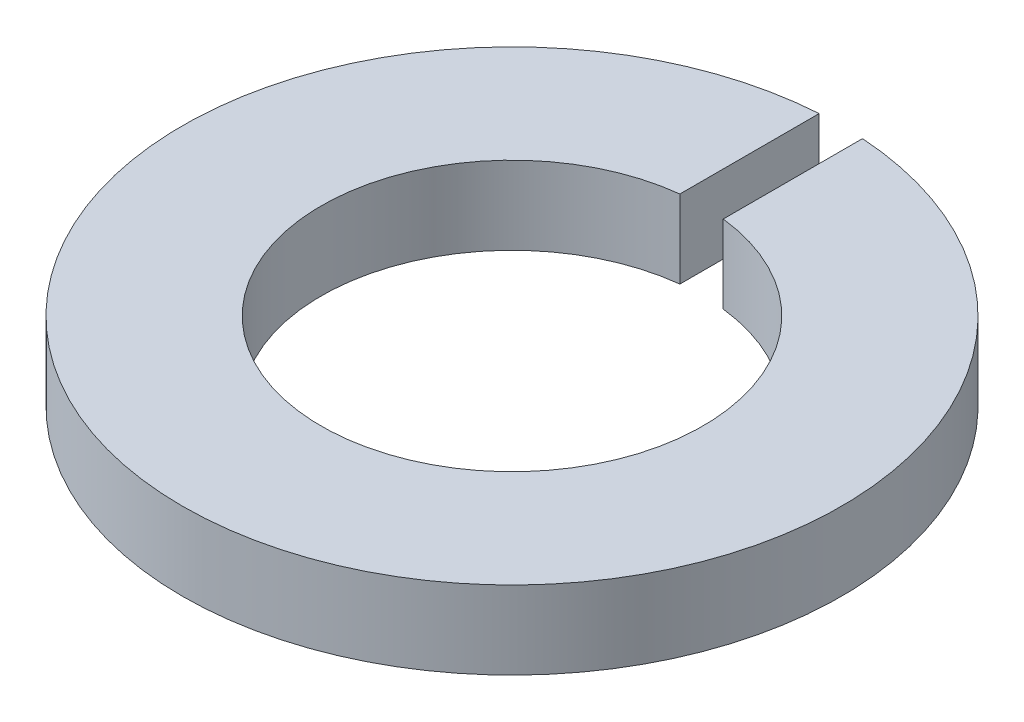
ISO-10303-21;
HEADER;
FILE_DESCRIPTION(('STEP AP214'),'2;1');
FILE_NAME('part.step','',(''),(''),'','','');
FILE_SCHEMA(('AUTOMOTIVE_DESIGN { 1 0 10303 214 1 1 1 1 }'));
ENDSEC;
DATA;
#1=APPLICATION_CONTEXT('core data for automotive mechanical design processes');
#2=APPLICATION_PROTOCOL_DEFINITION('international standard','automotive_design',2000,#1);
#3=PRODUCT_CONTEXT('',#1,'mechanical');
#4=PRODUCT('Part','Part','',(#3));
#5=PRODUCT_RELATED_PRODUCT_CATEGORY('part','',(#4));
#6=PRODUCT_DEFINITION_FORMATION('','',#4);
#7=PRODUCT_DEFINITION_CONTEXT('part definition',#1,'design');
#8=PRODUCT_DEFINITION('design','',#6,#7);
#9=PRODUCT_DEFINITION_SHAPE('','',#8);
#10=(LENGTH_UNIT() NAMED_UNIT(*) SI_UNIT(.MILLI.,.METRE.));
#11=(NAMED_UNIT(*) PLANE_ANGLE_UNIT() SI_UNIT($,.RADIAN.));
#12=(NAMED_UNIT(*) SI_UNIT($,.STERADIAN.) SOLID_ANGLE_UNIT());
#13=UNCERTAINTY_MEASURE_WITH_UNIT(LENGTH_MEASURE(1.E-05),#10,'distance_accuracy_value','');
#14=(GEOMETRIC_REPRESENTATION_CONTEXT(3) GLOBAL_UNCERTAINTY_ASSIGNED_CONTEXT((#13)) GLOBAL_UNIT_ASSIGNED_CONTEXT((#10,
#11,#12)) REPRESENTATION_CONTEXT('',''));
#15=CARTESIAN_POINT('',(0.,0.,0.));
#16=DIRECTION('',(0.,0.,1.));
#17=DIRECTION('',(1.,0.,0.));
#18=AXIS2_PLACEMENT_3D('',#15,#16,#17);
#19=CARTESIAN_POINT('',(0.,0.900000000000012,0.));
#20=DIRECTION('',(0.,-1.,0.));
#21=DIRECTION('',(0.,0.,-1.));
#22=AXIS2_PLACEMENT_3D('',#19,#20,#21);
#23=CYLINDRICAL_SURFACE('',#22,3.8);
#24=CARTESIAN_POINT('',(0.,0.,0.));
#25=DIRECTION('',(0.,1.,0.));
#26=DIRECTION('',(0.,0.,1.));
#27=AXIS2_PLACEMENT_3D('',#24,#25,#26);
#28=CIRCLE('',#27,3.8);
#29=CARTESIAN_POINT('',(-0.25,0.,-3.79176739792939));
#30=VERTEX_POINT('',#29);
#31=CARTESIAN_POINT('',(0.250000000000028,0.,-3.79176739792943));
#32=VERTEX_POINT('',#31);
#33=EDGE_CURVE('E41',#30,#32,#28,.T.);
#34=ORIENTED_EDGE('',*,*,#33,.T.);
#35=DIRECTION('',(0.,-1.,0.));
#36=VECTOR('',#35,1.);
#37=CARTESIAN_POINT('',(0.250000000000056,0.900000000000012,-3.79176739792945));
#38=LINE('',#37,#36);
#39=CARTESIAN_POINT('',(0.250000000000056,0.900000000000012,-3.79176739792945));
#40=VERTEX_POINT('',#39);
#41=EDGE_CURVE('E98',#40,#32,#38,.T.);
#42=ORIENTED_EDGE('',*,*,#41,.F.);
#43=CARTESIAN_POINT('',(0.,0.900000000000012,0.));
#44=DIRECTION('',(0.,1.,0.));
#45=DIRECTION('',(0.,0.,1.));
#46=AXIS2_PLACEMENT_3D('',#43,#44,#45);
#47=CIRCLE('',#46,3.8);
#48=CARTESIAN_POINT('',(-0.249999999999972,0.900000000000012,-3.79176739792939));
#49=VERTEX_POINT('',#48);
#50=EDGE_CURVE('E11',#49,#40,#47,.T.);
#51=ORIENTED_EDGE('',*,*,#50,.F.);
#52=DIRECTION('',(0.,-1.,0.));
#53=VECTOR('',#52,1.);
#54=CARTESIAN_POINT('',(-0.249999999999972,0.900000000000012,-3.79176739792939));
#55=LINE('',#54,#53);
#56=EDGE_CURVE('E80',#30,#49,#55,.F.);
#57=ORIENTED_EDGE('',*,*,#56,.F.);
#58=EDGE_LOOP('',(#34,#42,#51,#57));
#59=FACE_BOUND('',#58,.T.);
#60=ADVANCED_FACE('F34',(#59),#23,.T.);
#61=CARTESIAN_POINT('',(0.,0.900000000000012,0.));
#62=DIRECTION('',(0.,1.,0.));
#63=DIRECTION('',(0.,0.,1.));
#64=AXIS2_PLACEMENT_3D('',#61,#62,#63);
#65=PLANE('',#64);
#66=DIRECTION('',(0.,0.,-1.));
#67=VECTOR('',#66,1.);
#68=CARTESIAN_POINT('',(0.250000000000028,0.900000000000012,-2.18574929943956));
#69=LINE('',#68,#67);
#70=CARTESIAN_POINT('',(0.250000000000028,0.900000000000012,-2.18574929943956));
#71=VERTEX_POINT('',#70);
#72=EDGE_CURVE('E74',#71,#40,#69,.T.);
#73=ORIENTED_EDGE('',*,*,#72,.F.);
#74=CARTESIAN_POINT('',(0.,0.900000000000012,0.));
#75=DIRECTION('',(0.,1.,0.));
#76=DIRECTION('',(0.,0.,1.));
#77=AXIS2_PLACEMENT_3D('',#74,#75,#76);
#78=CIRCLE('',#77,2.2);
#79=CARTESIAN_POINT('',(-0.249999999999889,0.900000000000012,-2.18574929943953));
#80=VERTEX_POINT('',#79);
#81=EDGE_CURVE('E86',#80,#71,#78,.T.);
#82=ORIENTED_EDGE('',*,*,#81,.F.);
#83=DIRECTION('',(0.,0.,1.));
#84=VECTOR('',#83,1.);
#85=CARTESIAN_POINT('',(-0.249999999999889,0.900000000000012,-2.18574929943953));
#86=LINE('',#85,#84);
#87=EDGE_CURVE('E48',#49,#80,#86,.T.);
#88=ORIENTED_EDGE('',*,*,#87,.F.);
#89=ORIENTED_EDGE('',*,*,#50,.T.);
#90=EDGE_LOOP('',(#73,#82,#88,#89));
#91=FACE_BOUND('',#90,.T.);
#92=ADVANCED_FACE('F85',(#91),#65,.T.);
#93=CARTESIAN_POINT('',(0.,0.,0.));
#94=DIRECTION('',(0.,1.,0.));
#95=DIRECTION('',(0.,0.,1.));
#96=AXIS2_PLACEMENT_3D('',#93,#94,#95);
#97=PLANE('',#96);
#98=CARTESIAN_POINT('',(0.,0.,0.));
#99=DIRECTION('',(0.,1.,0.));
#100=DIRECTION('',(0.,0.,1.));
#101=AXIS2_PLACEMENT_3D('',#98,#99,#100);
#102=CIRCLE('',#101,2.2);
#103=CARTESIAN_POINT('',(-0.249999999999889,0.,-2.18574929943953));
#104=VERTEX_POINT('',#103);
#105=CARTESIAN_POINT('',(0.250000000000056,0.,-2.1857492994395));
#106=VERTEX_POINT('',#105);
#107=EDGE_CURVE('E90',#104,#106,#102,.T.);
#108=ORIENTED_EDGE('',*,*,#107,.T.);
#109=DIRECTION('',(0.,0.,1.));
#110=VECTOR('',#109,1.);
#111=CARTESIAN_POINT('',(0.250000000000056,0.,-2.1857492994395));
#112=LINE('',#111,#110);
#113=EDGE_CURVE('E56',#32,#106,#112,.T.);
#114=ORIENTED_EDGE('',*,*,#113,.F.);
#115=ORIENTED_EDGE('',*,*,#33,.F.);
#116=DIRECTION('',(0.,0.,-1.));
#117=VECTOR('',#116,1.);
#118=CARTESIAN_POINT('',(-0.249999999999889,0.,-2.18574929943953));
#119=LINE('',#118,#117);
#120=EDGE_CURVE('E102',#104,#30,#119,.T.);
#121=ORIENTED_EDGE('',*,*,#120,.F.);
#122=EDGE_LOOP('',(#108,#114,#115,#121));
#123=FACE_BOUND('',#122,.T.);
#124=ADVANCED_FACE('F101',(#123),#97,.F.);
#125=CARTESIAN_POINT('',(0.,0.,0.));
#126=DIRECTION('',(0.,1.,0.));
#127=DIRECTION('',(0.,0.,1.));
#128=AXIS2_PLACEMENT_3D('',#125,#126,#127);
#129=CYLINDRICAL_SURFACE('',#128,2.2);
#130=ORIENTED_EDGE('',*,*,#81,.T.);
#131=DIRECTION('',(0.,1.,0.));
#132=VECTOR('',#131,1.);
#133=CARTESIAN_POINT('',(0.250000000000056,0.,-2.1857492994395));
#134=LINE('',#133,#132);
#135=EDGE_CURVE('E71',#106,#71,#134,.T.);
#136=ORIENTED_EDGE('',*,*,#135,.F.);
#137=ORIENTED_EDGE('',*,*,#107,.F.);
#138=DIRECTION('',(0.,1.,0.));
#139=VECTOR('',#138,1.);
#140=CARTESIAN_POINT('',(-0.249999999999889,0.,-2.18574929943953));
#141=LINE('',#140,#139);
#142=EDGE_CURVE('E81',#80,#104,#141,.F.);
#143=ORIENTED_EDGE('',*,*,#142,.F.);
#144=EDGE_LOOP('',(#130,#136,#137,#143));
#145=FACE_BOUND('',#144,.T.);
#146=ADVANCED_FACE('F89',(#145),#129,.F.);
#147=CARTESIAN_POINT('',(-0.249999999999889,-0.000999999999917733,-2.18574929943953));
#148=DIRECTION('',(-1.,0.,0.));
#149=DIRECTION('',(0.,0.,1.));
#150=AXIS2_PLACEMENT_3D('',#147,#148,#149);
#151=PLANE('',#150);
#152=ORIENTED_EDGE('',*,*,#56,.T.);
#153=ORIENTED_EDGE('',*,*,#87,.T.);
#154=ORIENTED_EDGE('',*,*,#142,.T.);
#155=ORIENTED_EDGE('',*,*,#120,.T.);
#156=EDGE_LOOP('',(#152,#153,#154,#155));
#157=FACE_BOUND('',#156,.T.);
#158=ADVANCED_FACE('F108',(#157),#151,.F.);
#159=CARTESIAN_POINT('',(0.250000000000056,-0.000999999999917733,-2.1857492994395));
#160=DIRECTION('',(1.,0.,0.));
#161=DIRECTION('',(0.,0.,-1.));
#162=AXIS2_PLACEMENT_3D('',#159,#160,#161);
#163=PLANE('',#162);
#164=ORIENTED_EDGE('',*,*,#41,.T.);
#165=ORIENTED_EDGE('',*,*,#113,.T.);
#166=ORIENTED_EDGE('',*,*,#135,.T.);
#167=ORIENTED_EDGE('',*,*,#72,.T.);
#168=EDGE_LOOP('',(#164,#165,#166,#167));
#169=FACE_BOUND('',#168,.T.);
#170=ADVANCED_FACE('F73',(#169),#163,.F.);
#171=CLOSED_SHELL('',(#60,#92,#124,#146,#158,#170));
#172=MANIFOLD_SOLID_BREP('B2',#171);
#173=ADVANCED_BREP_SHAPE_REPRESENTATION('',(#18,#172),#14);
#174=SHAPE_DEFINITION_REPRESENTATION(#9,#173);
ENDSEC;
END-ISO-10303-21;
